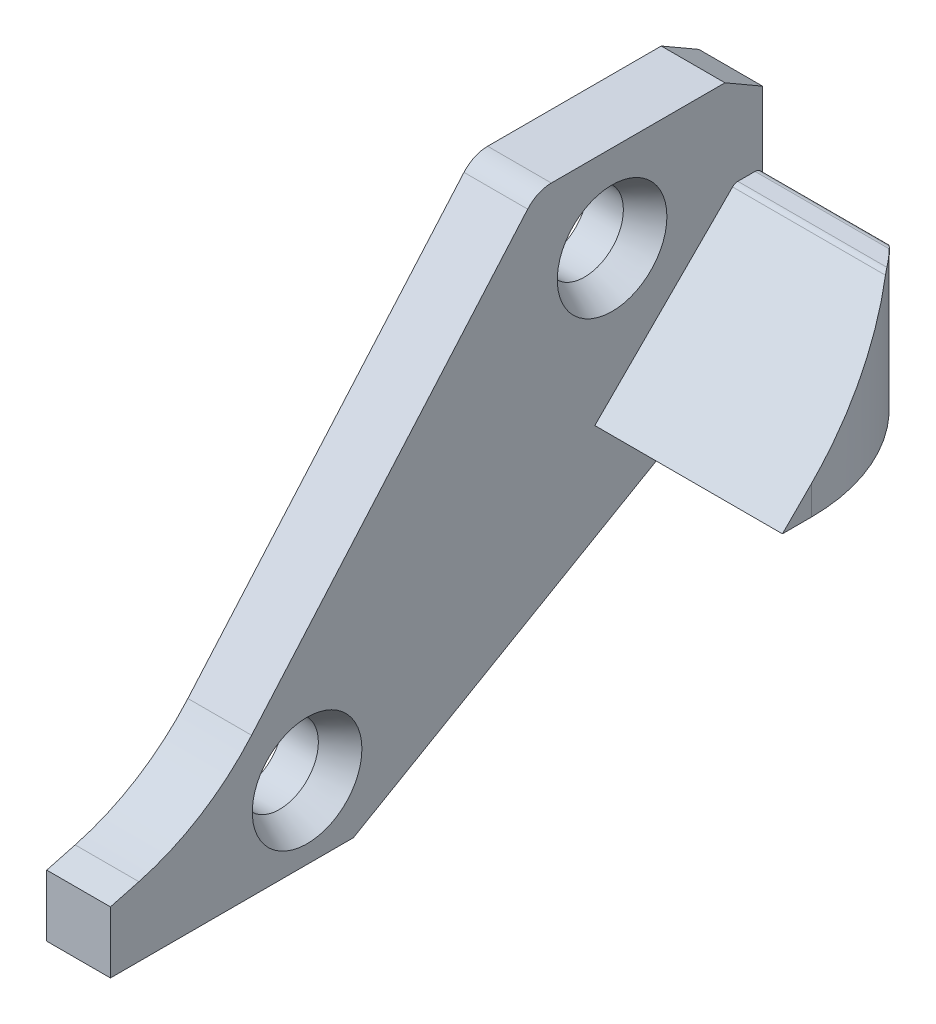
ISO-10303-21;
HEADER;
FILE_DESCRIPTION(('STEP AP214'),'2;1');
FILE_NAME('part.step','',(''),(''),'','','');
FILE_SCHEMA(('AUTOMOTIVE_DESIGN { 1 0 10303 214 1 1 1 1 }'));
ENDSEC;
DATA;
#1=APPLICATION_CONTEXT('core data for automotive mechanical design processes');
#2=APPLICATION_PROTOCOL_DEFINITION('international standard','automotive_design',2000,#1);
#3=PRODUCT_CONTEXT('',#1,'mechanical');
#4=PRODUCT('Part','Part','',(#3));
#5=PRODUCT_RELATED_PRODUCT_CATEGORY('part','',(#4));
#6=PRODUCT_DEFINITION_FORMATION('','',#4);
#7=PRODUCT_DEFINITION_CONTEXT('part definition',#1,'design');
#8=PRODUCT_DEFINITION('design','',#6,#7);
#9=PRODUCT_DEFINITION_SHAPE('','',#8);
#10=(LENGTH_UNIT() NAMED_UNIT(*) SI_UNIT(.MILLI.,.METRE.));
#11=(NAMED_UNIT(*) PLANE_ANGLE_UNIT() SI_UNIT($,.RADIAN.));
#12=(NAMED_UNIT(*) SI_UNIT($,.STERADIAN.) SOLID_ANGLE_UNIT());
#13=UNCERTAINTY_MEASURE_WITH_UNIT(LENGTH_MEASURE(1.E-05),#10,'distance_accuracy_value','');
#14=(GEOMETRIC_REPRESENTATION_CONTEXT(3) GLOBAL_UNCERTAINTY_ASSIGNED_CONTEXT((#13)) GLOBAL_UNIT_ASSIGNED_CONTEXT((#10,
#11,#12)) REPRESENTATION_CONTEXT('',''));
#15=CARTESIAN_POINT('',(0.,0.,0.));
#16=DIRECTION('',(0.,0.,1.));
#17=DIRECTION('',(1.,0.,0.));
#18=AXIS2_PLACEMENT_3D('',#15,#16,#17);
#19=CARTESIAN_POINT('',(3.2258,-4.68236806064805,26.9395251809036));
#20=DIRECTION('',(1.,0.,0.));
#21=DIRECTION('',(0.,0.,-1.));
#22=AXIS2_PLACEMENT_3D('',#19,#20,#21);
#23=PLANE('',#22);
#24=CARTESIAN_POINT('',(3.2258,-15.621,15.4432));
#25=DIRECTION('',(1.,0.,0.));
#26=DIRECTION('',(0.,0.,-1.));
#27=AXIS2_PLACEMENT_3D('',#24,#25,#26);
#28=CIRCLE('',#27,2.77505832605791);
#29=CARTESIAN_POINT('',(3.2258,-15.621,12.6681416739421));
#30=VERTEX_POINT('',#29);
#31=EDGE_CURVE('E45',#30,#30,#28,.F.);
#32=ORIENTED_EDGE('',*,*,#31,.T.);
#33=EDGE_LOOP('',(#32));
#34=FACE_BOUND('',#33,.T.);
#35=CARTESIAN_POINT('',(3.2258,0.,0.));
#36=DIRECTION('',(1.,0.,0.));
#37=DIRECTION('',(0.,0.,-1.));
#38=AXIS2_PLACEMENT_3D('',#35,#36,#37);
#39=CIRCLE('',#38,2.77505832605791);
#40=CARTESIAN_POINT('',(3.2258,0.,-2.77505832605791));
#41=VERTEX_POINT('',#40);
#42=EDGE_CURVE('E226',#41,#41,#39,.F.);
#43=ORIENTED_EDGE('',*,*,#42,.T.);
#44=EDGE_LOOP('',(#43));
#45=FACE_BOUND('',#44,.T.);
#46=DIRECTION('',(0.,0.,-1.));
#47=VECTOR('',#46,1.);
#48=CARTESIAN_POINT('',(3.2258,-7.3406,0.874815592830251));
#49=LINE('',#48,#47);
#50=CARTESIAN_POINT('',(3.2258,-7.3406,0.874815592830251));
#51=VERTEX_POINT('',#50);
#52=CARTESIAN_POINT('',(3.2258,-7.3406,-7.62));
#53=VERTEX_POINT('',#52);
#54=EDGE_CURVE('E60',#51,#53,#49,.T.);
#55=ORIENTED_EDGE('',*,*,#54,.F.);
#56=DIRECTION('',(0.,-0.707106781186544,0.707106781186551));
#57=VECTOR('',#56,1.);
#58=CARTESIAN_POINT('',(3.2258,-0.365592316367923,-6.1001920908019));
#59=LINE('',#58,#57);
#60=CARTESIAN_POINT('',(3.2258,-0.365592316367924,-6.1001920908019));
#61=VERTEX_POINT('',#60);
#62=EDGE_CURVE('E178',#61,#51,#59,.T.);
#63=ORIENTED_EDGE('',*,*,#62,.F.);
#64=CARTESIAN_POINT('',(3.2258,-0.634999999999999,-6.36959977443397));
#65=DIRECTION('',(1.,0.,0.));
#66=DIRECTION('',(0.,0.,-1.));
#67=AXIS2_PLACEMENT_3D('',#64,#65,#66);
#68=CIRCLE('',#67,0.381);
#69=CARTESIAN_POINT('',(3.2258,-0.253999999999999,-6.36959977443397));
#70=VERTEX_POINT('',#69);
#71=EDGE_CURVE('E191',#70,#61,#68,.T.);
#72=ORIENTED_EDGE('',*,*,#71,.F.);
#73=DIRECTION('',(0.,0.,1.));
#74=VECTOR('',#73,1.);
#75=CARTESIAN_POINT('',(3.2258,-0.253999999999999,-7.239));
#76=LINE('',#75,#74);
#77=CARTESIAN_POINT('',(3.2258,-0.253999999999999,-7.239));
#78=VERTEX_POINT('',#77);
#79=EDGE_CURVE('E187',#78,#70,#76,.T.);
#80=ORIENTED_EDGE('',*,*,#79,.F.);
#81=CARTESIAN_POINT('',(3.2258,-0.634999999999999,-7.239));
#82=DIRECTION('',(1.,0.,0.));
#83=DIRECTION('',(0.,0.,-1.));
#84=AXIS2_PLACEMENT_3D('',#81,#82,#83);
#85=CIRCLE('',#84,0.381);
#86=CARTESIAN_POINT('',(3.2258,-0.634999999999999,-7.62));
#87=VERTEX_POINT('',#86);
#88=EDGE_CURVE('E188',#87,#78,#85,.T.);
#89=ORIENTED_EDGE('',*,*,#88,.F.);
#90=DIRECTION('',(0.,1.,0.));
#91=VECTOR('',#90,1.);
#92=CARTESIAN_POINT('',(3.2258,3.29434773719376,-7.62));
#93=LINE('',#92,#91);
#94=CARTESIAN_POINT('',(3.2258,3.29434773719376,-7.62));
#95=VERTEX_POINT('',#94);
#96=EDGE_CURVE('E206',#87,#95,#93,.T.);
#97=ORIENTED_EDGE('',*,*,#96,.T.);
#98=DIRECTION('',(0.,0.500000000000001,0.866025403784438));
#99=VECTOR('',#98,1.);
#100=CARTESIAN_POINT('',(3.2258,4.3942,-5.715));
#101=LINE('',#100,#99);
#102=CARTESIAN_POINT('',(3.2258,4.3942,-5.715));
#103=VERTEX_POINT('',#102);
#104=EDGE_CURVE('E209',#95,#103,#101,.T.);
#105=ORIENTED_EDGE('',*,*,#104,.T.);
#106=DIRECTION('',(0.,0.,1.));
#107=VECTOR('',#106,1.);
#108=CARTESIAN_POINT('',(3.2258,4.3942,3.07584808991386));
#109=LINE('',#108,#107);
#110=CARTESIAN_POINT('',(3.2258,4.3942,3.07584808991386));
#111=VERTEX_POINT('',#110);
#112=EDGE_CURVE('E554',#103,#111,#109,.T.);
#113=ORIENTED_EDGE('',*,*,#112,.T.);
#114=CARTESIAN_POINT('',(3.2258,2.8067,3.07584808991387));
#115=DIRECTION('',(1.,0.,0.));
#116=DIRECTION('',(0.,0.,1.));
#117=AXIS2_PLACEMENT_3D('',#114,#115,#116);
#118=CIRCLE('',#117,1.5875);
#119=CARTESIAN_POINT('',(3.2258,3.84819370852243,4.27394954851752));
#120=VERTEX_POINT('',#119);
#121=EDGE_CURVE('E557',#111,#120,#118,.T.);
#122=ORIENTED_EDGE('',*,*,#121,.T.);
#123=DIRECTION('',(0.,-0.754709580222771,0.656059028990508));
#124=VECTOR('',#123,1.);
#125=CARTESIAN_POINT('',(3.2258,-12.2331974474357,18.2532896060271));
#126=LINE('',#125,#124);
#127=CARTESIAN_POINT('',(3.2258,-12.2331974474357,18.2532896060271));
#128=VERTEX_POINT('',#127);
#129=EDGE_CURVE('E558',#120,#128,#126,.T.);
#130=ORIENTED_EDGE('',*,*,#129,.T.);
#131=CARTESIAN_POINT('',(3.2258,-4.68236806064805,26.9395251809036));
#132=DIRECTION('',(-1.,0.,0.));
#133=DIRECTION('',(0.,0.,-1.));
#134=AXIS2_PLACEMENT_3D('',#131,#132,#133);
#135=CIRCLE('',#134,11.509375);
#136=CARTESIAN_POINT('',(3.2258,-15.7995706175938,23.9606797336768));
#137=VERTEX_POINT('',#136);
#138=EDGE_CURVE('E562',#128,#137,#135,.T.);
#139=ORIENTED_EDGE('',*,*,#138,.T.);
#140=DIRECTION('',(0.,-0.258819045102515,0.96592582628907));
#141=VECTOR('',#140,1.);
#142=CARTESIAN_POINT('',(3.2258,-16.1852353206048,25.4));
#143=LINE('',#142,#141);
#144=CARTESIAN_POINT('',(3.2258,-16.1852353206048,25.4));
#145=VERTEX_POINT('',#144);
#146=EDGE_CURVE('E564',#137,#145,#143,.T.);
#147=ORIENTED_EDGE('',*,*,#146,.T.);
#148=DIRECTION('',(0.,-1.,0.));
#149=VECTOR('',#148,1.);
#150=CARTESIAN_POINT('',(3.2258,-19.304,25.4));
#151=LINE('',#150,#149);
#152=CARTESIAN_POINT('',(3.2258,-19.304,25.4));
#153=VERTEX_POINT('',#152);
#154=EDGE_CURVE('E334',#145,#153,#151,.T.);
#155=ORIENTED_EDGE('',*,*,#154,.T.);
#156=DIRECTION('',(0.,0.,-1.));
#157=VECTOR('',#156,1.);
#158=CARTESIAN_POINT('',(3.2258,-19.304,13.1012166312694));
#159=LINE('',#158,#157);
#160=CARTESIAN_POINT('',(3.2258,-19.304,13.1012166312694));
#161=VERTEX_POINT('',#160);
#162=EDGE_CURVE('E200',#153,#161,#159,.T.);
#163=ORIENTED_EDGE('',*,*,#162,.T.);
#164=DIRECTION('',(0.,0.500000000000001,-0.866025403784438));
#165=VECTOR('',#164,1.);
#166=CARTESIAN_POINT('',(3.2258,-7.3406,-7.62));
#167=LINE('',#166,#165);
#168=EDGE_CURVE('E203',#161,#53,#167,.T.);
#169=ORIENTED_EDGE('',*,*,#168,.T.);
#170=EDGE_LOOP('',(#55,#63,#72,#80,#89,#97,#105,#113,#122,#130,#139,#147,#155,#163,#169));
#171=FACE_BOUND('',#170,.T.);
#172=ADVANCED_FACE('F37',(#34,#45,#171),#23,.T.);
#173=CARTESIAN_POINT('',(0.,-4.68236806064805,26.9395251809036));
#174=DIRECTION('',(1.,0.,0.));
#175=DIRECTION('',(0.,0.,-1.));
#176=AXIS2_PLACEMENT_3D('',#173,#174,#175);
#177=PLANE('',#176);
#178=CARTESIAN_POINT('',(0.,0.,0.));
#179=DIRECTION('',(1.,0.,0.));
#180=DIRECTION('',(0.,0.,-1.));
#181=AXIS2_PLACEMENT_3D('',#178,#179,#180);
#182=CIRCLE('',#181,1.9685);
#183=CARTESIAN_POINT('',(0.,0.,-1.9685));
#184=VERTEX_POINT('',#183);
#185=EDGE_CURVE('E176',#184,#184,#182,.T.);
#186=ORIENTED_EDGE('',*,*,#185,.T.);
#187=EDGE_LOOP('',(#186));
#188=FACE_BOUND('',#187,.T.);
#189=DIRECTION('',(0.,0.,-1.));
#190=VECTOR('',#189,1.);
#191=CARTESIAN_POINT('',(0.,-19.304,13.1012166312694));
#192=LINE('',#191,#190);
#193=CARTESIAN_POINT('',(0.,-19.304,25.4));
#194=VERTEX_POINT('',#193);
#195=CARTESIAN_POINT('',(0.,-19.304,13.1012166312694));
#196=VERTEX_POINT('',#195);
#197=EDGE_CURVE('E199',#194,#196,#192,.T.);
#198=ORIENTED_EDGE('',*,*,#197,.F.);
#199=DIRECTION('',(0.,-1.,0.));
#200=VECTOR('',#199,1.);
#201=CARTESIAN_POINT('',(0.,-19.304,25.4));
#202=LINE('',#201,#200);
#203=CARTESIAN_POINT('',(0.,-16.1852353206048,25.4));
#204=VERTEX_POINT('',#203);
#205=EDGE_CURVE('E204',#204,#194,#202,.T.);
#206=ORIENTED_EDGE('',*,*,#205,.F.);
#207=DIRECTION('',(0.,-0.258819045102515,0.96592582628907));
#208=VECTOR('',#207,1.);
#209=CARTESIAN_POINT('',(0.,-16.1852353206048,25.4));
#210=LINE('',#209,#208);
#211=CARTESIAN_POINT('',(0.,-15.7995706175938,23.9606797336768));
#212=VERTEX_POINT('',#211);
#213=EDGE_CURVE('E327',#212,#204,#210,.T.);
#214=ORIENTED_EDGE('',*,*,#213,.F.);
#215=CARTESIAN_POINT('',(0.,-4.68236806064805,26.9395251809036));
#216=DIRECTION('',(-1.,0.,0.));
#217=DIRECTION('',(0.,0.,-1.));
#218=AXIS2_PLACEMENT_3D('',#215,#216,#217);
#219=CIRCLE('',#218,11.509375);
#220=CARTESIAN_POINT('',(0.,-12.2331974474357,18.2532896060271));
#221=VERTEX_POINT('',#220);
#222=EDGE_CURVE('E325',#221,#212,#219,.T.);
#223=ORIENTED_EDGE('',*,*,#222,.F.);
#224=DIRECTION('',(0.,-0.754709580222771,0.656059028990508));
#225=VECTOR('',#224,1.);
#226=CARTESIAN_POINT('',(0.,-12.2331974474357,18.2532896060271));
#227=LINE('',#226,#225);
#228=CARTESIAN_POINT('',(0.,3.84819370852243,4.27394954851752));
#229=VERTEX_POINT('',#228);
#230=EDGE_CURVE('E323',#229,#221,#227,.T.);
#231=ORIENTED_EDGE('',*,*,#230,.F.);
#232=CARTESIAN_POINT('',(0.,2.8067,3.07584808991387));
#233=DIRECTION('',(1.,0.,0.));
#234=DIRECTION('',(0.,0.,1.));
#235=AXIS2_PLACEMENT_3D('',#232,#233,#234);
#236=CIRCLE('',#235,1.5875);
#237=CARTESIAN_POINT('',(0.,4.3942,3.07584808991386));
#238=VERTEX_POINT('',#237);
#239=EDGE_CURVE('E321',#238,#229,#236,.T.);
#240=ORIENTED_EDGE('',*,*,#239,.F.);
#241=DIRECTION('',(0.,0.,1.));
#242=VECTOR('',#241,1.);
#243=CARTESIAN_POINT('',(0.,4.3942,3.07584808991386));
#244=LINE('',#243,#242);
#245=CARTESIAN_POINT('',(0.,4.3942,-5.715));
#246=VERTEX_POINT('',#245);
#247=EDGE_CURVE('E316',#246,#238,#244,.T.);
#248=ORIENTED_EDGE('',*,*,#247,.F.);
#249=DIRECTION('',(0.,0.500000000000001,0.866025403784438));
#250=VECTOR('',#249,1.);
#251=CARTESIAN_POINT('',(0.,4.3942,-5.715));
#252=LINE('',#251,#250);
#253=CARTESIAN_POINT('',(0.,3.29434773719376,-7.62));
#254=VERTEX_POINT('',#253);
#255=EDGE_CURVE('E314',#254,#246,#252,.T.);
#256=ORIENTED_EDGE('',*,*,#255,.F.);
#257=DIRECTION('',(0.,1.,0.));
#258=VECTOR('',#257,1.);
#259=CARTESIAN_POINT('',(0.,3.29434773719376,-7.62));
#260=LINE('',#259,#258);
#261=CARTESIAN_POINT('',(0.,-7.3406,-7.62));
#262=VERTEX_POINT('',#261);
#263=EDGE_CURVE('E306',#262,#254,#260,.T.);
#264=ORIENTED_EDGE('',*,*,#263,.F.);
#265=DIRECTION('',(0.,0.500000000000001,-0.866025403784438));
#266=VECTOR('',#265,1.);
#267=CARTESIAN_POINT('',(0.,-7.3406,-7.62));
#268=LINE('',#267,#266);
#269=EDGE_CURVE('E299',#196,#262,#268,.T.);
#270=ORIENTED_EDGE('',*,*,#269,.F.);
#271=EDGE_LOOP('',(#198,#206,#214,#223,#231,#240,#248,#256,#264,#270));
#272=FACE_BOUND('',#271,.T.);
#273=CARTESIAN_POINT('',(0.,-15.621,15.4432));
#274=DIRECTION('',(1.,0.,0.));
#275=DIRECTION('',(0.,0.,-1.));
#276=AXIS2_PLACEMENT_3D('',#273,#274,#275);
#277=CIRCLE('',#276,1.9685);
#278=CARTESIAN_POINT('',(0.,-15.621,13.4747));
#279=VERTEX_POINT('',#278);
#280=EDGE_CURVE('E173',#279,#279,#277,.T.);
#281=ORIENTED_EDGE('',*,*,#280,.T.);
#282=EDGE_LOOP('',(#281));
#283=FACE_BOUND('',#282,.T.);
#284=ADVANCED_FACE('F245',(#188,#272,#283),#177,.F.);
#285=CARTESIAN_POINT('',(3.2258,-19.304,13.1012166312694));
#286=DIRECTION('',(0.,1.,0.));
#287=DIRECTION('',(0.,0.,1.));
#288=AXIS2_PLACEMENT_3D('',#285,#286,#287);
#289=PLANE('',#288);
#290=ORIENTED_EDGE('',*,*,#197,.T.);
#291=DIRECTION('',(-1.,0.,0.));
#292=VECTOR('',#291,1.);
#293=CARTESIAN_POINT('',(3.2258,-19.304,13.1012166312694));
#294=LINE('',#293,#292);
#295=EDGE_CURVE('E214',#161,#196,#294,.T.);
#296=ORIENTED_EDGE('',*,*,#295,.F.);
#297=ORIENTED_EDGE('',*,*,#162,.F.);
#298=DIRECTION('',(-1.,0.,0.));
#299=VECTOR('',#298,1.);
#300=CARTESIAN_POINT('',(3.2258,-19.304,25.4));
#301=LINE('',#300,#299);
#302=EDGE_CURVE('E330',#153,#194,#301,.T.);
#303=ORIENTED_EDGE('',*,*,#302,.T.);
#304=EDGE_LOOP('',(#290,#296,#297,#303));
#305=FACE_BOUND('',#304,.T.);
#306=ADVANCED_FACE('F247',(#305),#289,.F.);
#307=CARTESIAN_POINT('',(3.2258,-7.3406,-7.62));
#308=DIRECTION('',(0.,0.866025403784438,0.500000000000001));
#309=DIRECTION('',(0.,-0.500000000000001,0.866025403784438));
#310=AXIS2_PLACEMENT_3D('',#307,#308,#309);
#311=PLANE('',#310);
#312=ORIENTED_EDGE('',*,*,#269,.T.);
#313=DIRECTION('',(-1.,0.,0.));
#314=VECTOR('',#313,1.);
#315=CARTESIAN_POINT('',(3.2258,-7.3406,-7.62));
#316=LINE('',#315,#314);
#317=EDGE_CURVE('E301',#53,#262,#316,.T.);
#318=ORIENTED_EDGE('',*,*,#317,.F.);
#319=ORIENTED_EDGE('',*,*,#168,.F.);
#320=ORIENTED_EDGE('',*,*,#295,.T.);
#321=EDGE_LOOP('',(#312,#318,#319,#320));
#322=FACE_BOUND('',#321,.T.);
#323=ADVANCED_FACE('F254',(#322),#311,.F.);
#324=CARTESIAN_POINT('',(3.2258,3.29434773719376,-7.62));
#325=DIRECTION('',(0.,0.,1.));
#326=DIRECTION('',(0.,-1.,0.));
#327=AXIS2_PLACEMENT_3D('',#324,#325,#326);
#328=PLANE('',#327);
#329=DIRECTION('',(-1.,0.,0.));
#330=VECTOR('',#329,1.);
#331=CARTESIAN_POINT('',(36.5134304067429,-0.635000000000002,-7.62));
#332=LINE('',#331,#330);
#333=CARTESIAN_POINT('',(9.6266,-0.635000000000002,-7.62));
#334=VERTEX_POINT('',#333);
#335=EDGE_CURVE('E184',#334,#87,#332,.T.);
#336=ORIENTED_EDGE('',*,*,#335,.F.);
#337=DIRECTION('',(0.,1.,0.));
#338=VECTOR('',#337,1.);
#339=CARTESIAN_POINT('',(9.6266,-15.0238375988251,-7.62));
#340=LINE('',#339,#338);
#341=CARTESIAN_POINT('',(9.6266,-7.3406,-7.62));
#342=VERTEX_POINT('',#341);
#343=EDGE_CURVE('E160',#342,#334,#340,.T.);
#344=ORIENTED_EDGE('',*,*,#343,.F.);
#345=DIRECTION('',(-1.,0.,0.));
#346=VECTOR('',#345,1.);
#347=CARTESIAN_POINT('',(36.5134304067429,-7.3406,-7.62));
#348=LINE('',#347,#346);
#349=EDGE_CURVE('E168',#342,#53,#348,.T.);
#350=ORIENTED_EDGE('',*,*,#349,.T.);
#351=ORIENTED_EDGE('',*,*,#317,.T.);
#352=ORIENTED_EDGE('',*,*,#263,.T.);
#353=DIRECTION('',(-1.,0.,0.));
#354=VECTOR('',#353,1.);
#355=CARTESIAN_POINT('',(3.2258,3.29434773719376,-7.62));
#356=LINE('',#355,#354);
#357=EDGE_CURVE('E311',#95,#254,#356,.T.);
#358=ORIENTED_EDGE('',*,*,#357,.F.);
#359=ORIENTED_EDGE('',*,*,#96,.F.);
#360=EDGE_LOOP('',(#336,#344,#350,#351,#352,#358,#359));
#361=FACE_BOUND('',#360,.T.);
#362=ADVANCED_FACE('F288',(#361),#328,.F.);
#363=CARTESIAN_POINT('',(3.2258,4.3942,-5.715));
#364=DIRECTION('',(0.,-0.866025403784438,0.500000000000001));
#365=DIRECTION('',(0.,-0.500000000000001,-0.866025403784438));
#366=AXIS2_PLACEMENT_3D('',#363,#364,#365);
#367=PLANE('',#366);
#368=ORIENTED_EDGE('',*,*,#255,.T.);
#369=DIRECTION('',(-1.,0.,0.));
#370=VECTOR('',#369,1.);
#371=CARTESIAN_POINT('',(3.2258,4.3942,-5.715));
#372=LINE('',#371,#370);
#373=EDGE_CURVE('E349',#103,#246,#372,.T.);
#374=ORIENTED_EDGE('',*,*,#373,.F.);
#375=ORIENTED_EDGE('',*,*,#104,.F.);
#376=ORIENTED_EDGE('',*,*,#357,.T.);
#377=EDGE_LOOP('',(#368,#374,#375,#376));
#378=FACE_BOUND('',#377,.T.);
#379=ADVANCED_FACE('F284',(#378),#367,.F.);
#380=CARTESIAN_POINT('',(3.2258,4.3942,3.07584808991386));
#381=DIRECTION('',(0.,-1.,0.));
#382=DIRECTION('',(0.,0.,-1.));
#383=AXIS2_PLACEMENT_3D('',#380,#381,#382);
#384=PLANE('',#383);
#385=ORIENTED_EDGE('',*,*,#247,.T.);
#386=DIRECTION('',(-1.,0.,0.));
#387=VECTOR('',#386,1.);
#388=CARTESIAN_POINT('',(3.2258,4.3942,3.07584808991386));
#389=LINE('',#388,#387);
#390=EDGE_CURVE('E346',#111,#238,#389,.T.);
#391=ORIENTED_EDGE('',*,*,#390,.F.);
#392=ORIENTED_EDGE('',*,*,#112,.F.);
#393=ORIENTED_EDGE('',*,*,#373,.T.);
#394=EDGE_LOOP('',(#385,#391,#392,#393));
#395=FACE_BOUND('',#394,.T.);
#396=ADVANCED_FACE('F280',(#395),#384,.F.);
#397=CARTESIAN_POINT('',(3.2258,2.8067,3.07584808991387));
#398=DIRECTION('',(-1.,0.,0.));
#399=DIRECTION('',(0.,0.,1.));
#400=AXIS2_PLACEMENT_3D('',#397,#398,#399);
#401=CYLINDRICAL_SURFACE('',#400,1.5875);
#402=ORIENTED_EDGE('',*,*,#239,.T.);
#403=DIRECTION('',(-1.,0.,0.));
#404=VECTOR('',#403,1.);
#405=CARTESIAN_POINT('',(3.2258,3.84819370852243,4.27394954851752));
#406=LINE('',#405,#404);
#407=EDGE_CURVE('E343',#120,#229,#406,.T.);
#408=ORIENTED_EDGE('',*,*,#407,.F.);
#409=ORIENTED_EDGE('',*,*,#121,.F.);
#410=ORIENTED_EDGE('',*,*,#390,.T.);
#411=EDGE_LOOP('',(#402,#408,#409,#410));
#412=FACE_BOUND('',#411,.T.);
#413=ADVANCED_FACE('F276',(#412),#401,.T.);
#414=CARTESIAN_POINT('',(3.2258,-12.2331974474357,18.2532896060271));
#415=DIRECTION('',(0.,-0.656059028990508,-0.754709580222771));
#416=DIRECTION('',(0.,0.754709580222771,-0.656059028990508));
#417=AXIS2_PLACEMENT_3D('',#414,#415,#416);
#418=PLANE('',#417);
#419=ORIENTED_EDGE('',*,*,#230,.T.);
#420=DIRECTION('',(-1.,0.,0.));
#421=VECTOR('',#420,1.);
#422=CARTESIAN_POINT('',(3.2258,-12.2331974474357,18.2532896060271));
#423=LINE('',#422,#421);
#424=EDGE_CURVE('E340',#128,#221,#423,.T.);
#425=ORIENTED_EDGE('',*,*,#424,.F.);
#426=ORIENTED_EDGE('',*,*,#129,.F.);
#427=ORIENTED_EDGE('',*,*,#407,.T.);
#428=EDGE_LOOP('',(#419,#425,#426,#427));
#429=FACE_BOUND('',#428,.T.);
#430=ADVANCED_FACE('F272',(#429),#418,.F.);
#431=CARTESIAN_POINT('',(3.2258,-4.68236806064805,26.9395251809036));
#432=DIRECTION('',(-1.,0.,0.));
#433=DIRECTION('',(0.,0.,1.));
#434=AXIS2_PLACEMENT_3D('',#431,#432,#433);
#435=CYLINDRICAL_SURFACE('',#434,11.509375);
#436=ORIENTED_EDGE('',*,*,#222,.T.);
#437=DIRECTION('',(-1.,0.,0.));
#438=VECTOR('',#437,1.);
#439=CARTESIAN_POINT('',(3.2258,-15.7995706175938,23.9606797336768));
#440=LINE('',#439,#438);
#441=EDGE_CURVE('E337',#137,#212,#440,.T.);
#442=ORIENTED_EDGE('',*,*,#441,.F.);
#443=ORIENTED_EDGE('',*,*,#138,.F.);
#444=ORIENTED_EDGE('',*,*,#424,.T.);
#445=EDGE_LOOP('',(#436,#442,#443,#444));
#446=FACE_BOUND('',#445,.T.);
#447=ADVANCED_FACE('F268',(#446),#435,.F.);
#448=CARTESIAN_POINT('',(3.2258,-16.1852353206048,25.4));
#449=DIRECTION('',(0.,-0.96592582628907,-0.258819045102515));
#450=DIRECTION('',(0.,0.258819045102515,-0.96592582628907));
#451=AXIS2_PLACEMENT_3D('',#448,#449,#450);
#452=PLANE('',#451);
#453=ORIENTED_EDGE('',*,*,#213,.T.);
#454=DIRECTION('',(-1.,0.,0.));
#455=VECTOR('',#454,1.);
#456=CARTESIAN_POINT('',(3.2258,-16.1852353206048,25.4));
#457=LINE('',#456,#455);
#458=EDGE_CURVE('E333',#145,#204,#457,.T.);
#459=ORIENTED_EDGE('',*,*,#458,.F.);
#460=ORIENTED_EDGE('',*,*,#146,.F.);
#461=ORIENTED_EDGE('',*,*,#441,.T.);
#462=EDGE_LOOP('',(#453,#459,#460,#461));
#463=FACE_BOUND('',#462,.T.);
#464=ADVANCED_FACE('F264',(#463),#452,.F.);
#465=CARTESIAN_POINT('',(3.2258,-19.304,25.4));
#466=DIRECTION('',(0.,0.,-1.));
#467=DIRECTION('',(-1.,0.,0.));
#468=AXIS2_PLACEMENT_3D('',#465,#466,#467);
#469=PLANE('',#468);
#470=ORIENTED_EDGE('',*,*,#205,.T.);
#471=ORIENTED_EDGE('',*,*,#302,.F.);
#472=ORIENTED_EDGE('',*,*,#154,.F.);
#473=ORIENTED_EDGE('',*,*,#458,.T.);
#474=EDGE_LOOP('',(#470,#471,#472,#473));
#475=FACE_BOUND('',#474,.T.);
#476=ADVANCED_FACE('F261',(#475),#469,.F.);
#477=CARTESIAN_POINT('',(3.2258,0.,0.));
#478=DIRECTION('',(-1.,0.,0.));
#479=DIRECTION('',(0.,0.,1.));
#480=AXIS2_PLACEMENT_3D('',#477,#478,#479);
#481=CYLINDRICAL_SURFACE('',#480,1.9685);
#482=CARTESIAN_POINT('',(1.82879999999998,0.,0.));
#483=DIRECTION('',(1.,0.,0.));
#484=DIRECTION('',(0.,0.,-1.));
#485=AXIS2_PLACEMENT_3D('',#482,#483,#484);
#486=CIRCLE('',#485,1.9685);
#487=CARTESIAN_POINT('',(1.82879999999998,0.,-1.9685));
#488=VERTEX_POINT('',#487);
#489=EDGE_CURVE('E12',#488,#488,#486,.T.);
#490=ORIENTED_EDGE('',*,*,#489,.T.);
#491=EDGE_LOOP('',(#490));
#492=FACE_BOUND('',#491,.T.);
#493=ORIENTED_EDGE('',*,*,#185,.F.);
#494=EDGE_LOOP('',(#493));
#495=FACE_BOUND('',#494,.T.);
#496=ADVANCED_FACE('F241',(#492,#495),#481,.F.);
#497=CARTESIAN_POINT('',(3.2258,-15.621,15.4432));
#498=DIRECTION('',(-1.,0.,0.));
#499=DIRECTION('',(0.,0.,1.));
#500=AXIS2_PLACEMENT_3D('',#497,#498,#499);
#501=CYLINDRICAL_SURFACE('',#500,1.9685);
#502=CARTESIAN_POINT('',(1.82879999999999,-15.621,15.4432));
#503=DIRECTION('',(1.,0.,0.));
#504=DIRECTION('',(0.,0.,-1.));
#505=AXIS2_PLACEMENT_3D('',#502,#503,#504);
#506=CIRCLE('',#505,1.9685);
#507=CARTESIAN_POINT('',(1.82879999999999,-15.621,13.4747));
#508=VERTEX_POINT('',#507);
#509=EDGE_CURVE('E223',#508,#508,#506,.T.);
#510=ORIENTED_EDGE('',*,*,#509,.T.);
#511=EDGE_LOOP('',(#510));
#512=FACE_BOUND('',#511,.T.);
#513=ORIENTED_EDGE('',*,*,#280,.F.);
#514=EDGE_LOOP('',(#513));
#515=FACE_BOUND('',#514,.T.);
#516=ADVANCED_FACE('F238',(#512,#515),#501,.F.);
#517=CARTESIAN_POINT('',(36.5134304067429,-7.3406,0.874815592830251));
#518=DIRECTION('',(0.,1.,0.));
#519=DIRECTION('',(0.,0.,1.));
#520=AXIS2_PLACEMENT_3D('',#517,#518,#519);
#521=PLANE('',#520);
#522=ORIENTED_EDGE('',*,*,#349,.F.);
#523=CARTESIAN_POINT('',(3.2004,-7.3406,-0.589382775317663));
#524=DIRECTION('',(0.,1.,0.));
#525=DIRECTION('',(0.,0.,1.));
#526=AXIS2_PLACEMENT_3D('',#523,#524,#525);
#527=CIRCLE('',#526,9.525);
#528=CARTESIAN_POINT('',(12.7254,-7.3406,-0.589382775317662));
#529=VERTEX_POINT('',#528);
#530=EDGE_CURVE('E155',#529,#342,#527,.T.);
#531=ORIENTED_EDGE('',*,*,#530,.F.);
#532=DIRECTION('',(0.,0.,-1.));
#533=VECTOR('',#532,1.);
#534=CARTESIAN_POINT('',(12.7254,-7.3406,0.874815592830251));
#535=LINE('',#534,#533);
#536=CARTESIAN_POINT('',(12.7254,-7.3406,0.874815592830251));
#537=VERTEX_POINT('',#536);
#538=EDGE_CURVE('E167',#537,#529,#535,.T.);
#539=ORIENTED_EDGE('',*,*,#538,.F.);
#540=DIRECTION('',(-1.,0.,0.));
#541=VECTOR('',#540,1.);
#542=CARTESIAN_POINT('',(36.5134304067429,-7.3406,0.874815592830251));
#543=LINE('',#542,#541);
#544=EDGE_CURVE('E194',#537,#51,#543,.T.);
#545=ORIENTED_EDGE('',*,*,#544,.T.);
#546=ORIENTED_EDGE('',*,*,#54,.T.);
#547=EDGE_LOOP('',(#522,#531,#539,#545,#546));
#548=FACE_BOUND('',#547,.T.);
#549=ADVANCED_FACE('F166',(#548),#521,.F.);
#550=CARTESIAN_POINT('',(36.5134304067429,-0.634999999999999,-7.239));
#551=DIRECTION('',(-1.,0.,0.));
#552=DIRECTION('',(0.,0.,1.));
#553=AXIS2_PLACEMENT_3D('',#550,#551,#552);
#554=CYLINDRICAL_SURFACE('',#553,0.381);
#555=DIRECTION('',(-1.,0.,0.));
#556=VECTOR('',#555,1.);
#557=CARTESIAN_POINT('',(36.5134304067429,-0.253999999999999,-7.239));
#558=LINE('',#557,#556);
#559=CARTESIAN_POINT('',(10.0200932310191,-0.253999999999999,-7.239));
#560=VERTEX_POINT('',#559);
#561=EDGE_CURVE('E185',#560,#78,#558,.T.);
#562=ORIENTED_EDGE('',*,*,#561,.F.);
#563=CARTESIAN_POINT('',(10.0200932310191,-0.253999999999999,-7.239));
#564=CARTESIAN_POINT('',(10.0056623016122,-0.254005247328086,-7.25380032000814));
#565=CARTESIAN_POINT('',(9.99119315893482,-0.254862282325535,-7.26854265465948));
#566=CARTESIAN_POINT('',(9.96224553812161,-0.25828156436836,-7.29784719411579));
#567=CARTESIAN_POINT('',(9.94776706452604,-0.260845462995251,-7.31240921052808));
#568=CARTESIAN_POINT('',(9.90422831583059,-0.271152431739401,-7.35591756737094));
#569=CARTESIAN_POINT('',(9.87529987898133,-0.28151093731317,-7.38444515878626));
#570=CARTESIAN_POINT('',(9.82654352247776,-0.305698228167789,-7.43194668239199));
#571=CARTESIAN_POINT('',(9.80635995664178,-0.317845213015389,-7.45142706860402));
#572=CARTESIAN_POINT('',(9.76743624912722,-0.346270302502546,-7.48868547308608));
#573=CARTESIAN_POINT('',(9.74869151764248,-0.362534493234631,-7.50646895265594));
#574=CARTESIAN_POINT('',(9.71877650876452,-0.39404590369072,-7.53464616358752));
#575=CARTESIAN_POINT('',(9.70700879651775,-0.40816361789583,-7.54566712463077));
#576=CARTESIAN_POINT('',(9.68513591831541,-0.438714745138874,-7.56606158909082));
#577=CARTESIAN_POINT('',(9.67502893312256,-0.455145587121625,-7.57543689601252));
#578=CARTESIAN_POINT('',(9.65909930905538,-0.486420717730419,-7.59016271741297));
#579=CARTESIAN_POINT('',(9.65282304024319,-0.500828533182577,-7.5959450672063));
#580=CARTESIAN_POINT('',(9.64208195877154,-0.530831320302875,-7.60582145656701));
#581=CARTESIAN_POINT('',(9.6376125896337,-0.546423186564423,-7.60991974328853));
#582=CARTESIAN_POINT('',(9.63173252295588,-0.57418992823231,-7.61530613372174));
#583=CARTESIAN_POINT('',(9.62982469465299,-0.58617222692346,-7.61705154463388));
#584=CARTESIAN_POINT('',(9.62725059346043,-0.610430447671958,-7.61940534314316));
#585=CARTESIAN_POINT('',(9.62658971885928,-0.622707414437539,-7.6200087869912));
#586=CARTESIAN_POINT('',(9.6266,-0.635000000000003,-7.62));
#587=B_SPLINE_CURVE_WITH_KNOTS('',3,(#563,#564,#565,#566,#567,#568,#569,#570,#571,#572,#573,
#574,#575,#576,#577,#578,#579,#580,#581,#582,#583,#584,#585,#586),.UNSPECIFIED.,.F.,.F.,(4,2,2,
2,2,2,2,2,2,2,2,4),(0.,0.0619666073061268,0.123993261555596,0.249045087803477,0.34047535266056,
0.431600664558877,0.495694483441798,0.559717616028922,0.609766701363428,0.659688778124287,
0.696349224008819,0.733168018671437),.UNSPECIFIED.);
#588=EDGE_CURVE('E195',#560,#334,#587,.T.);
#589=ORIENTED_EDGE('',*,*,#588,.T.);
#590=ORIENTED_EDGE('',*,*,#335,.T.);
#591=ORIENTED_EDGE('',*,*,#88,.T.);
#592=EDGE_LOOP('',(#562,#589,#590,#591));
#593=FACE_BOUND('',#592,.T.);
#594=ADVANCED_FACE('F361',(#593),#554,.T.);
#595=CARTESIAN_POINT('',(36.5134304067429,-0.253999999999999,-7.239));
#596=DIRECTION('',(0.,-1.,0.));
#597=DIRECTION('',(0.,0.,-1.));
#598=AXIS2_PLACEMENT_3D('',#595,#596,#597);
#599=PLANE('',#598);
#600=DIRECTION('',(-1.,0.,0.));
#601=VECTOR('',#600,1.);
#602=CARTESIAN_POINT('',(36.5134304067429,-0.253999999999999,-6.36959977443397));
#603=LINE('',#602,#601);
#604=CARTESIAN_POINT('',(10.7710483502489,-0.253999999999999,-6.36959977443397));
#605=VERTEX_POINT('',#604);
#606=EDGE_CURVE('E189',#605,#70,#603,.T.);
#607=ORIENTED_EDGE('',*,*,#606,.F.);
#608=CARTESIAN_POINT('',(3.2004,-0.254,-0.589382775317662));
#609=DIRECTION('',(0.,-1.,0.));
#610=DIRECTION('',(0.,0.,-1.));
#611=AXIS2_PLACEMENT_3D('',#608,#609,#610);
#612=CIRCLE('',#611,9.525);
#613=EDGE_CURVE('E161',#560,#605,#612,.T.);
#614=ORIENTED_EDGE('',*,*,#613,.F.);
#615=ORIENTED_EDGE('',*,*,#561,.T.);
#616=ORIENTED_EDGE('',*,*,#79,.T.);
#617=EDGE_LOOP('',(#607,#614,#615,#616));
#618=FACE_BOUND('',#617,.T.);
#619=ADVANCED_FACE('F393',(#618),#599,.F.);
#620=CARTESIAN_POINT('',(36.5134304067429,-0.634999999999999,-6.36959977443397));
#621=DIRECTION('',(-1.,0.,0.));
#622=DIRECTION('',(0.,0.,1.));
#623=AXIS2_PLACEMENT_3D('',#620,#621,#622);
#624=CYLINDRICAL_SURFACE('',#623,0.381);
#625=DIRECTION('',(-1.,0.,0.));
#626=VECTOR('',#625,1.);
#627=CARTESIAN_POINT('',(36.5134304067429,-0.365592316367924,-6.1001920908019));
#628=LINE('',#627,#626);
#629=CARTESIAN_POINT('',(10.9693513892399,-0.365592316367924,-6.1001920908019));
#630=VERTEX_POINT('',#629);
#631=EDGE_CURVE('E192',#630,#61,#628,.T.);
#632=ORIENTED_EDGE('',*,*,#631,.F.);
#633=CARTESIAN_POINT('',(10.9693513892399,-0.365592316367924,-6.1001920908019));
#634=CARTESIAN_POINT('',(10.9570225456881,-0.34821472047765,-6.1175797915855));
#635=CARTESIAN_POINT('',(10.9437141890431,-0.332930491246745,-6.13621158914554));
#636=CARTESIAN_POINT('',(10.9156726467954,-0.306518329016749,-6.17514544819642));
#637=CARTESIAN_POINT('',(10.9009449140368,-0.295375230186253,-6.19544107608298));
#638=CARTESIAN_POINT('',(10.870562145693,-0.27712460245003,-6.2369400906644));
#639=CARTESIAN_POINT('',(10.8549111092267,-0.270000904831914,-6.25813946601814));
#640=CARTESIAN_POINT('',(10.8229879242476,-0.259580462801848,-6.30099273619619));
#641=CARTESIAN_POINT('',(10.8067160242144,-0.256282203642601,-6.32264644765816));
#642=CARTESIAN_POINT('',(10.7839029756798,-0.254279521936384,-6.35273445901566));
#643=CARTESIAN_POINT('',(10.7774812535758,-0.254000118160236,-6.36117471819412));
#644=CARTESIAN_POINT('',(10.7710483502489,-0.253999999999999,-6.36959977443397));
#645=B_SPLINE_CURVE_WITH_KNOTS('',3,(#633,#634,#635,#636,#637,#638,#639,#640,#641,#642,#643,
#644),.UNSPECIFIED.,.F.,.F.,(4,2,2,2,2,4),(0.,0.082241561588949,0.164178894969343,
0.245784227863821,0.327357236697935,0.359167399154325),.UNSPECIFIED.);
#646=EDGE_CURVE('E364',#630,#605,#645,.T.);
#647=ORIENTED_EDGE('',*,*,#646,.T.);
#648=ORIENTED_EDGE('',*,*,#606,.T.);
#649=ORIENTED_EDGE('',*,*,#71,.T.);
#650=EDGE_LOOP('',(#632,#647,#648,#649));
#651=FACE_BOUND('',#650,.T.);
#652=ADVANCED_FACE('F389',(#651),#624,.T.);
#653=CARTESIAN_POINT('',(36.5134304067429,-0.365592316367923,-6.1001920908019));
#654=DIRECTION('',(0.,-0.707106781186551,-0.707106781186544));
#655=DIRECTION('',(0.,0.707106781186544,-0.707106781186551));
#656=AXIS2_PLACEMENT_3D('',#653,#654,#655);
#657=PLANE('',#656);
#658=DIRECTION('',(0.,-0.707106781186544,0.707106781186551));
#659=VECTOR('',#658,1.);
#660=CARTESIAN_POINT('',(12.7254,-0.365592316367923,-6.1001920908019));
#661=LINE('',#660,#659);
#662=CARTESIAN_POINT('',(12.7254,-5.87640163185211,-0.58938277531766));
#663=VERTEX_POINT('',#662);
#664=EDGE_CURVE('E171',#663,#537,#661,.T.);
#665=ORIENTED_EDGE('',*,*,#664,.F.);
#666=CARTESIAN_POINT('',(3.2004,-5.8764016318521,-0.589382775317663));
#667=DIRECTION('',(0.,-0.707106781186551,-0.707106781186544));
#668=DIRECTION('',(0.,0.707106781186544,-0.707106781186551));
#669=AXIS2_PLACEMENT_3D('',#666,#667,#668);
#670=ELLIPSE('',#669,13.4703841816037,9.525);
#671=EDGE_CURVE('E52',#663,#630,#670,.F.);
#672=ORIENTED_EDGE('',*,*,#671,.T.);
#673=ORIENTED_EDGE('',*,*,#631,.T.);
#674=ORIENTED_EDGE('',*,*,#62,.T.);
#675=ORIENTED_EDGE('',*,*,#544,.F.);
#676=EDGE_LOOP('',(#665,#672,#673,#674,#675));
#677=FACE_BOUND('',#676,.T.);
#678=ADVANCED_FACE('F386',(#677),#657,.F.);
#679=CARTESIAN_POINT('',(12.7254,-4.68236806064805,26.9395251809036));
#680=DIRECTION('',(1.,0.,0.));
#681=DIRECTION('',(0.,0.,-1.));
#682=AXIS2_PLACEMENT_3D('',#679,#680,#681);
#683=PLANE('',#682);
#684=DIRECTION('',(0.,1.,0.));
#685=VECTOR('',#684,1.);
#686=CARTESIAN_POINT('',(12.7254,-15.0238375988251,-0.589382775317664));
#687=LINE('',#686,#685);
#688=EDGE_CURVE('E152',#529,#663,#687,.T.);
#689=ORIENTED_EDGE('',*,*,#688,.T.);
#690=ORIENTED_EDGE('',*,*,#664,.T.);
#691=ORIENTED_EDGE('',*,*,#538,.T.);
#692=EDGE_LOOP('',(#689,#690,#691));
#693=FACE_BOUND('',#692,.T.);
#694=ADVANCED_FACE('F170',(#693),#683,.T.);
#695=CARTESIAN_POINT('',(3.2004,-15.0238375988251,-0.589382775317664));
#696=DIRECTION('',(0.,1.,0.));
#697=DIRECTION('',(0.,0.,1.));
#698=AXIS2_PLACEMENT_3D('',#695,#696,#697);
#699=CYLINDRICAL_SURFACE('',#698,9.525);
#700=ORIENTED_EDGE('',*,*,#613,.T.);
#701=ORIENTED_EDGE('',*,*,#646,.F.);
#702=ORIENTED_EDGE('',*,*,#671,.F.);
#703=ORIENTED_EDGE('',*,*,#688,.F.);
#704=ORIENTED_EDGE('',*,*,#530,.T.);
#705=ORIENTED_EDGE('',*,*,#343,.T.);
#706=ORIENTED_EDGE('',*,*,#588,.F.);
#707=EDGE_LOOP('',(#700,#701,#702,#703,#704,#705,#706));
#708=FACE_BOUND('',#707,.T.);
#709=ADVANCED_FACE('F154',(#708),#699,.T.);
#710=CARTESIAN_POINT('',(1.82879999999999,-15.621,15.4432));
#711=DIRECTION('',(1.,0.,0.));
#712=DIRECTION('',(0.,0.,-1.));
#713=AXIS2_PLACEMENT_3D('',#710,#711,#712);
#714=CONICAL_SURFACE('',#713,1.9685,0.523598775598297);
#715=ORIENTED_EDGE('',*,*,#31,.F.);
#716=EDGE_LOOP('',(#715));
#717=FACE_BOUND('',#716,.T.);
#718=ORIENTED_EDGE('',*,*,#509,.F.);
#719=EDGE_LOOP('',(#718));
#720=FACE_BOUND('',#719,.T.);
#721=ADVANCED_FACE('F233',(#717,#720),#714,.F.);
#722=CARTESIAN_POINT('',(1.82879999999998,0.,0.));
#723=DIRECTION('',(1.,0.,0.));
#724=DIRECTION('',(0.,0.,-1.));
#725=AXIS2_PLACEMENT_3D('',#722,#723,#724);
#726=CONICAL_SURFACE('',#725,1.9685,0.523598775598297);
#727=ORIENTED_EDGE('',*,*,#42,.F.);
#728=EDGE_LOOP('',(#727));
#729=FACE_BOUND('',#728,.T.);
#730=ORIENTED_EDGE('',*,*,#489,.F.);
#731=EDGE_LOOP('',(#730));
#732=FACE_BOUND('',#731,.T.);
#733=ADVANCED_FACE('F39',(#729,#732),#726,.F.);
#734=CLOSED_SHELL('',(#172,#284,#306,#323,#362,#379,#396,#413,#430,#447,#464,#476,#496,#516,
#549,#594,#619,#652,#678,#694,#709,#721,#733));
#735=MANIFOLD_SOLID_BREP('B2',#734);
#736=ADVANCED_BREP_SHAPE_REPRESENTATION('',(#18,#735),#14);
#737=SHAPE_DEFINITION_REPRESENTATION(#9,#736);
ENDSEC;
END-ISO-10303-21;
